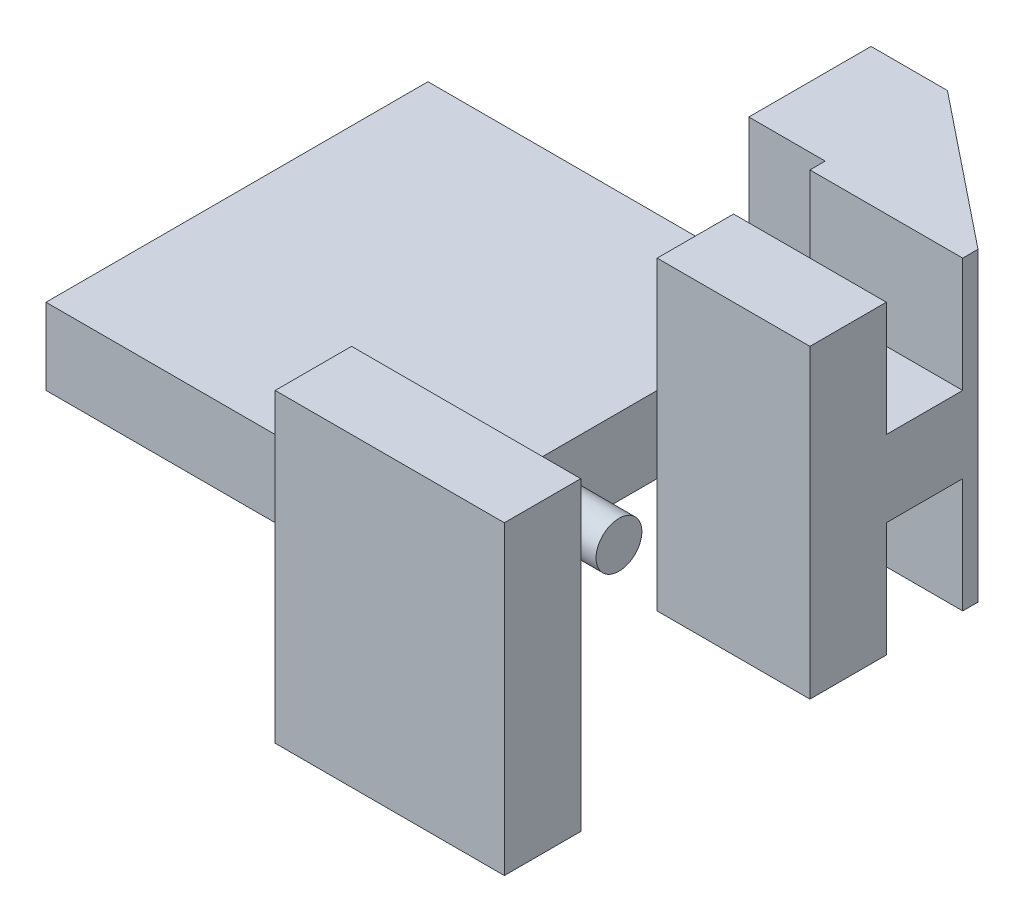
ISO-10303-21;
HEADER;
FILE_DESCRIPTION(('STEP AP214'),'2;1');
FILE_NAME('part.step','',(''),(''),'','','');
FILE_SCHEMA(('AUTOMOTIVE_DESIGN { 1 0 10303 214 1 1 1 1 }'));
ENDSEC;
DATA;
#1=APPLICATION_CONTEXT('core data for automotive mechanical design processes');
#2=APPLICATION_PROTOCOL_DEFINITION('international standard','automotive_design',2000,#1);
#3=PRODUCT_CONTEXT('',#1,'mechanical');
#4=PRODUCT('Part','Part','',(#3));
#5=PRODUCT_RELATED_PRODUCT_CATEGORY('part','',(#4));
#6=PRODUCT_DEFINITION_FORMATION('','',#4);
#7=PRODUCT_DEFINITION_CONTEXT('part definition',#1,'design');
#8=PRODUCT_DEFINITION('design','',#6,#7);
#9=PRODUCT_DEFINITION_SHAPE('','',#8);
#10=(LENGTH_UNIT() NAMED_UNIT(*) SI_UNIT(.MILLI.,.METRE.));
#11=(NAMED_UNIT(*) PLANE_ANGLE_UNIT() SI_UNIT($,.RADIAN.));
#12=(NAMED_UNIT(*) SI_UNIT($,.STERADIAN.) SOLID_ANGLE_UNIT());
#13=UNCERTAINTY_MEASURE_WITH_UNIT(LENGTH_MEASURE(1.E-05),#10,'distance_accuracy_value','');
#14=(GEOMETRIC_REPRESENTATION_CONTEXT(3) GLOBAL_UNCERTAINTY_ASSIGNED_CONTEXT((#13)) GLOBAL_UNIT_ASSIGNED_CONTEXT((#10,
#11,#12)) REPRESENTATION_CONTEXT('',''));
#15=CARTESIAN_POINT('',(0.,0.,0.));
#16=DIRECTION('',(0.,0.,1.));
#17=DIRECTION('',(1.,0.,0.));
#18=AXIS2_PLACEMENT_3D('',#15,#16,#17);
#19=CARTESIAN_POINT('',(0.,-10.,0.));
#20=DIRECTION('',(0.,1.,0.));
#21=DIRECTION('',(0.,0.,1.));
#22=AXIS2_PLACEMENT_3D('',#19,#20,#21);
#23=PLANE('',#22);
#24=DIRECTION('',(0.,0.,-1.));
#25=VECTOR('',#24,1.);
#26=CARTESIAN_POINT('',(10.,-10.,-18.5));
#27=LINE('',#26,#25);
#28=CARTESIAN_POINT('',(10.,-10.,-17.5));
#29=VERTEX_POINT('',#28);
#30=CARTESIAN_POINT('',(10.,-10.,-18.5));
#31=VERTEX_POINT('',#30);
#32=EDGE_CURVE('E283',#29,#31,#27,.T.);
#33=ORIENTED_EDGE('',*,*,#32,.F.);
#34=DIRECTION('',(-1.,0.,0.));
#35=VECTOR('',#34,1.);
#36=CARTESIAN_POINT('',(10.,-10.,-17.5));
#37=LINE('',#36,#35);
#38=CARTESIAN_POINT('',(0.,-10.,-17.5));
#39=VERTEX_POINT('',#38);
#40=EDGE_CURVE('E528',#29,#39,#37,.T.);
#41=ORIENTED_EDGE('',*,*,#40,.T.);
#42=DIRECTION('',(0.,0.,-1.));
#43=VECTOR('',#42,1.);
#44=CARTESIAN_POINT('',(0.,-10.,0.));
#45=LINE('',#44,#43);
#46=CARTESIAN_POINT('',(0.,-10.,-18.5));
#47=VERTEX_POINT('',#46);
#48=EDGE_CURVE('E363',#39,#47,#45,.T.);
#49=ORIENTED_EDGE('',*,*,#48,.T.);
#50=DIRECTION('',(1.,0.,0.));
#51=VECTOR('',#50,1.);
#52=CARTESIAN_POINT('',(0.,-10.,-18.5));
#53=LINE('',#52,#51);
#54=CARTESIAN_POINT('',(-5.,-10.,-18.5));
#55=VERTEX_POINT('',#54);
#56=EDGE_CURVE('E368',#55,#47,#53,.T.);
#57=ORIENTED_EDGE('',*,*,#56,.F.);
#58=DIRECTION('',(0.,0.,1.));
#59=VECTOR('',#58,1.);
#60=CARTESIAN_POINT('',(-5.,-10.,-26.5));
#61=LINE('',#60,#59);
#62=CARTESIAN_POINT('',(-5.,-10.,-26.5));
#63=VERTEX_POINT('',#62);
#64=EDGE_CURVE('E295',#63,#55,#61,.T.);
#65=ORIENTED_EDGE('',*,*,#64,.F.);
#66=DIRECTION('',(-1.,0.,0.));
#67=VECTOR('',#66,1.);
#68=CARTESIAN_POINT('',(-5.,-10.,-26.5));
#69=LINE('',#68,#67);
#70=CARTESIAN_POINT('',(0.,-10.,-26.5));
#71=VERTEX_POINT('',#70);
#72=EDGE_CURVE('E292',#71,#63,#69,.T.);
#73=ORIENTED_EDGE('',*,*,#72,.F.);
#74=DIRECTION('',(-0.78086880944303,0.,-0.624695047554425));
#75=VECTOR('',#74,1.);
#76=CARTESIAN_POINT('',(0.,-10.,-26.5));
#77=LINE('',#76,#75);
#78=EDGE_CURVE('E289',#31,#71,#77,.T.);
#79=ORIENTED_EDGE('',*,*,#78,.F.);
#80=EDGE_LOOP('',(#33,#41,#49,#57,#65,#73,#79));
#81=FACE_BOUND('',#80,.T.);
#82=ADVANCED_FACE('F39',(#81),#23,.F.);
#83=CARTESIAN_POINT('',(0.,10.,0.));
#84=DIRECTION('',(0.,1.,0.));
#85=DIRECTION('',(0.,0.,1.));
#86=AXIS2_PLACEMENT_3D('',#83,#84,#85);
#87=PLANE('',#86);
#88=DIRECTION('',(-1.,0.,0.));
#89=VECTOR('',#88,1.);
#90=CARTESIAN_POINT('',(10.,10.,-12.5));
#91=LINE('',#90,#89);
#92=CARTESIAN_POINT('',(10.,10.,-12.5));
#93=VERTEX_POINT('',#92);
#94=CARTESIAN_POINT('',(0.,10.,-12.5));
#95=VERTEX_POINT('',#94);
#96=EDGE_CURVE('E221',#93,#95,#91,.T.);
#97=ORIENTED_EDGE('',*,*,#96,.T.);
#98=DIRECTION('',(0.,0.,-1.));
#99=VECTOR('',#98,1.);
#100=CARTESIAN_POINT('',(0.,10.,0.));
#101=LINE('',#100,#99);
#102=CARTESIAN_POINT('',(0.,10.,-7.5));
#103=VERTEX_POINT('',#102);
#104=EDGE_CURVE('E48',#103,#95,#101,.T.);
#105=ORIENTED_EDGE('',*,*,#104,.F.);
#106=DIRECTION('',(1.,0.,0.));
#107=VECTOR('',#106,1.);
#108=CARTESIAN_POINT('',(10.,10.,-7.5));
#109=LINE('',#108,#107);
#110=CARTESIAN_POINT('',(10.,10.,-7.5));
#111=VERTEX_POINT('',#110);
#112=EDGE_CURVE('E248',#103,#111,#109,.T.);
#113=ORIENTED_EDGE('',*,*,#112,.T.);
#114=DIRECTION('',(0.,0.,-1.));
#115=VECTOR('',#114,1.);
#116=CARTESIAN_POINT('',(10.,10.,-18.5));
#117=LINE('',#116,#115);
#118=EDGE_CURVE('E239',#111,#93,#117,.T.);
#119=ORIENTED_EDGE('',*,*,#118,.T.);
#120=EDGE_LOOP('',(#97,#105,#113,#119));
#121=FACE_BOUND('',#120,.T.);
#122=ADVANCED_FACE('F246',(#121),#87,.T.);
#123=CARTESIAN_POINT('',(0.,0.,0.));
#124=DIRECTION('',(1.,0.,0.));
#125=DIRECTION('',(0.,0.,-1.));
#126=AXIS2_PLACEMENT_3D('',#123,#124,#125);
#127=PLANE('',#126);
#128=ORIENTED_EDGE('',*,*,#48,.F.);
#129=DIRECTION('',(0.,-1.,0.));
#130=VECTOR('',#129,1.);
#131=CARTESIAN_POINT('',(0.,-10.,-17.5));
#132=LINE('',#131,#130);
#133=CARTESIAN_POINT('',(0.,-2.5,-17.5));
#134=VERTEX_POINT('',#133);
#135=EDGE_CURVE('E606',#134,#39,#132,.T.);
#136=ORIENTED_EDGE('',*,*,#135,.F.);
#137=DIRECTION('',(0.,0.,1.));
#138=VECTOR('',#137,1.);
#139=CARTESIAN_POINT('',(0.,-2.5,0.));
#140=LINE('',#139,#138);
#141=CARTESIAN_POINT('',(0.,-2.5,-18.5));
#142=VERTEX_POINT('',#141);
#143=EDGE_CURVE('E535',#142,#134,#140,.T.);
#144=ORIENTED_EDGE('',*,*,#143,.F.);
#145=DIRECTION('',(0.,-1.,0.));
#146=VECTOR('',#145,1.);
#147=CARTESIAN_POINT('',(0.,0.,-18.5));
#148=LINE('',#147,#146);
#149=EDGE_CURVE('E533',#142,#47,#148,.T.);
#150=ORIENTED_EDGE('',*,*,#149,.T.);
#151=EDGE_LOOP('',(#128,#136,#144,#150));
#152=FACE_BOUND('',#151,.T.);
#153=ADVANCED_FACE('F466',(#152),#127,.F.);
#154=CARTESIAN_POINT('',(0.,0.,0.));
#155=DIRECTION('',(1.,0.,0.));
#156=DIRECTION('',(0.,0.,-1.));
#157=AXIS2_PLACEMENT_3D('',#154,#155,#156);
#158=PLANE('',#157);
#159=ORIENTED_EDGE('',*,*,#104,.T.);
#160=DIRECTION('',(0.,1.,0.));
#161=VECTOR('',#160,1.);
#162=CARTESIAN_POINT('',(0.,2.5,-12.5));
#163=LINE('',#162,#161);
#164=CARTESIAN_POINT('',(0.,2.5,-12.5));
#165=VERTEX_POINT('',#164);
#166=EDGE_CURVE('E227',#165,#95,#163,.T.);
#167=ORIENTED_EDGE('',*,*,#166,.F.);
#168=DIRECTION('',(0.,0.,-1.));
#169=VECTOR('',#168,1.);
#170=CARTESIAN_POINT('',(0.,2.5,0.));
#171=LINE('',#170,#169);
#172=CARTESIAN_POINT('',(0.,2.5,-7.5));
#173=VERTEX_POINT('',#172);
#174=EDGE_CURVE('E559',#173,#165,#171,.T.);
#175=ORIENTED_EDGE('',*,*,#174,.F.);
#176=DIRECTION('',(0.,-1.,0.));
#177=VECTOR('',#176,1.);
#178=CARTESIAN_POINT('',(0.,10.,-7.5));
#179=LINE('',#178,#177);
#180=EDGE_CURVE('E359',#103,#173,#179,.T.);
#181=ORIENTED_EDGE('',*,*,#180,.F.);
#182=EDGE_LOOP('',(#159,#167,#175,#181));
#183=FACE_BOUND('',#182,.T.);
#184=ADVANCED_FACE('F577',(#183),#158,.F.);
#185=CARTESIAN_POINT('',(-5.,10.,-26.5));
#186=DIRECTION('',(1.,0.,0.));
#187=DIRECTION('',(0.,0.,-1.));
#188=AXIS2_PLACEMENT_3D('',#185,#186,#187);
#189=PLANE('',#188);
#190=DIRECTION('',(0.,-1.,0.));
#191=VECTOR('',#190,1.);
#192=CARTESIAN_POINT('',(-5.,10.,-17.5));
#193=LINE('',#192,#191);
#194=CARTESIAN_POINT('',(-5.,2.5,-17.5));
#195=VERTEX_POINT('',#194);
#196=CARTESIAN_POINT('',(-5.,-2.5,-17.5));
#197=VERTEX_POINT('',#196);
#198=EDGE_CURVE('E339',#195,#197,#193,.T.);
#199=ORIENTED_EDGE('',*,*,#198,.F.);
#200=DIRECTION('',(0.,0.,-1.));
#201=VECTOR('',#200,1.);
#202=CARTESIAN_POINT('',(-5.,2.5,-26.5));
#203=LINE('',#202,#201);
#204=CARTESIAN_POINT('',(-5.,2.5,-18.5));
#205=VERTEX_POINT('',#204);
#206=EDGE_CURVE('E284',#195,#205,#203,.T.);
#207=ORIENTED_EDGE('',*,*,#206,.T.);
#208=DIRECTION('',(0.,1.,0.));
#209=VECTOR('',#208,1.);
#210=CARTESIAN_POINT('',(-5.,10.,-18.5));
#211=LINE('',#210,#209);
#212=CARTESIAN_POINT('',(-5.,10.,-18.5));
#213=VERTEX_POINT('',#212);
#214=EDGE_CURVE('E406',#205,#213,#211,.T.);
#215=ORIENTED_EDGE('',*,*,#214,.T.);
#216=DIRECTION('',(0.,0.,1.));
#217=VECTOR('',#216,1.);
#218=CARTESIAN_POINT('',(-5.,10.,-26.5));
#219=LINE('',#218,#217);
#220=CARTESIAN_POINT('',(-5.,10.,-26.5));
#221=VERTEX_POINT('',#220);
#222=EDGE_CURVE('E263',#221,#213,#219,.T.);
#223=ORIENTED_EDGE('',*,*,#222,.F.);
#224=DIRECTION('',(0.,-1.,0.));
#225=VECTOR('',#224,1.);
#226=CARTESIAN_POINT('',(-5.,10.,-26.5));
#227=LINE('',#226,#225);
#228=EDGE_CURVE('E343',#221,#63,#227,.T.);
#229=ORIENTED_EDGE('',*,*,#228,.T.);
#230=ORIENTED_EDGE('',*,*,#64,.T.);
#231=DIRECTION('',(0.,-1.,0.));
#232=VECTOR('',#231,1.);
#233=CARTESIAN_POINT('',(-5.,10.,-18.5));
#234=LINE('',#233,#232);
#235=CARTESIAN_POINT('',(-5.,-2.5,-18.5));
#236=VERTEX_POINT('',#235);
#237=EDGE_CURVE('E409',#236,#55,#234,.T.);
#238=ORIENTED_EDGE('',*,*,#237,.F.);
#239=DIRECTION('',(0.,0.,1.));
#240=VECTOR('',#239,1.);
#241=CARTESIAN_POINT('',(-5.,-2.5,-26.5));
#242=LINE('',#241,#240);
#243=EDGE_CURVE('E414',#236,#197,#242,.T.);
#244=ORIENTED_EDGE('',*,*,#243,.T.);
#245=EDGE_LOOP('',(#199,#207,#215,#223,#229,#230,#238,#244));
#246=FACE_BOUND('',#245,.T.);
#247=ADVANCED_FACE('F403',(#246),#189,.F.);
#248=DIRECTION('',(-1.,0.,0.));
#249=VECTOR('',#248,1.);
#250=CARTESIAN_POINT('',(10.,10.,7.5));
#251=LINE('',#250,#249);
#252=CARTESIAN_POINT('',(10.,10.,7.5));
#253=VERTEX_POINT('',#252);
#254=CARTESIAN_POINT('',(-5.,10.,7.5));
#255=VERTEX_POINT('',#254);
#256=EDGE_CURVE('E276',#253,#255,#251,.T.);
#257=ORIENTED_EDGE('',*,*,#256,.T.);
#258=DIRECTION('',(0.,0.,1.));
#259=VECTOR('',#258,1.);
#260=CARTESIAN_POINT('',(-5.,10.,7.5));
#261=LINE('',#260,#259);
#262=CARTESIAN_POINT('',(-5.,10.,12.5));
#263=VERTEX_POINT('',#262);
#264=EDGE_CURVE('E267',#255,#263,#261,.T.);
#265=ORIENTED_EDGE('',*,*,#264,.T.);
#266=DIRECTION('',(1.,0.,0.));
#267=VECTOR('',#266,1.);
#268=CARTESIAN_POINT('',(-5.,10.,12.5));
#269=LINE('',#268,#267);
#270=CARTESIAN_POINT('',(10.,10.,12.5));
#271=VERTEX_POINT('',#270);
#272=EDGE_CURVE('E270',#263,#271,#269,.T.);
#273=ORIENTED_EDGE('',*,*,#272,.T.);
#274=DIRECTION('',(0.,0.,-1.));
#275=VECTOR('',#274,1.);
#276=CARTESIAN_POINT('',(10.,10.,12.5));
#277=LINE('',#276,#275);
#278=EDGE_CURVE('E273',#271,#253,#277,.T.);
#279=ORIENTED_EDGE('',*,*,#278,.T.);
#280=EDGE_LOOP('',(#257,#265,#273,#279));
#281=FACE_BOUND('',#280,.T.);
#282=ADVANCED_FACE('F468',(#281),#87,.T.);
#283=CARTESIAN_POINT('',(0.,-10.,-7.5));
#284=VERTEX_POINT('',#283);
#285=CARTESIAN_POINT('',(0.,-10.,-12.5));
#286=VERTEX_POINT('',#285);
#287=EDGE_CURVE('E364',#284,#286,#45,.T.);
#288=ORIENTED_EDGE('',*,*,#287,.T.);
#289=DIRECTION('',(-1.,0.,0.));
#290=VECTOR('',#289,1.);
#291=CARTESIAN_POINT('',(10.,-10.,-12.5));
#292=LINE('',#291,#290);
#293=CARTESIAN_POINT('',(10.,-10.,-12.5));
#294=VERTEX_POINT('',#293);
#295=EDGE_CURVE('E55',#294,#286,#292,.T.);
#296=ORIENTED_EDGE('',*,*,#295,.F.);
#297=CARTESIAN_POINT('',(10.,-10.,-7.5));
#298=VERTEX_POINT('',#297);
#299=EDGE_CURVE('E285',#298,#294,#27,.T.);
#300=ORIENTED_EDGE('',*,*,#299,.F.);
#301=DIRECTION('',(1.,0.,0.));
#302=VECTOR('',#301,1.);
#303=CARTESIAN_POINT('',(10.,-10.,-7.5));
#304=LINE('',#303,#302);
#305=EDGE_CURVE('E280',#284,#298,#304,.T.);
#306=ORIENTED_EDGE('',*,*,#305,.F.);
#307=EDGE_LOOP('',(#288,#296,#300,#306));
#308=FACE_BOUND('',#307,.T.);
#309=ADVANCED_FACE('F461',(#308),#23,.F.);
#310=CARTESIAN_POINT('',(0.,10.,-7.5));
#311=DIRECTION('',(-1.,0.,0.));
#312=DIRECTION('',(0.,0.,1.));
#313=AXIS2_PLACEMENT_3D('',#310,#311,#312);
#314=PLANE('',#313);
#315=CARTESIAN_POINT('',(0.,0.,0.));
#316=DIRECTION('',(-1.,0.,0.));
#317=DIRECTION('',(0.,0.,1.));
#318=AXIS2_PLACEMENT_3D('',#315,#316,#317);
#319=CIRCLE('',#318,1.5);
#320=CARTESIAN_POINT('',(0.,0.,1.5));
#321=VERTEX_POINT('',#320);
#322=EDGE_CURVE('E11',#321,#321,#319,.F.);
#323=ORIENTED_EDGE('',*,*,#322,.F.);
#324=EDGE_LOOP('',(#323));
#325=FACE_BOUND('',#324,.T.);
#326=CARTESIAN_POINT('',(0.,-2.5,-7.5));
#327=VERTEX_POINT('',#326);
#328=EDGE_CURVE('E358',#173,#327,#179,.T.);
#329=ORIENTED_EDGE('',*,*,#328,.F.);
#330=CARTESIAN_POINT('',(0.,2.5,7.5));
#331=VERTEX_POINT('',#330);
#332=EDGE_CURVE('E395',#331,#173,#171,.T.);
#333=ORIENTED_EDGE('',*,*,#332,.F.);
#334=DIRECTION('',(0.,-1.,0.));
#335=VECTOR('',#334,1.);
#336=CARTESIAN_POINT('',(0.,10.,7.5));
#337=LINE('',#336,#335);
#338=CARTESIAN_POINT('',(0.,-2.5,7.5));
#339=VERTEX_POINT('',#338);
#340=EDGE_CURVE('E279',#331,#339,#337,.T.);
#341=ORIENTED_EDGE('',*,*,#340,.T.);
#342=EDGE_CURVE('E539',#327,#339,#140,.T.);
#343=ORIENTED_EDGE('',*,*,#342,.F.);
#344=EDGE_LOOP('',(#329,#333,#341,#343));
#345=FACE_BOUND('',#344,.T.);
#346=ADVANCED_FACE('F41',(#325,#345),#314,.F.);
#347=CARTESIAN_POINT('',(10.,10.,-7.5));
#348=DIRECTION('',(0.,0.,-1.));
#349=DIRECTION('',(-1.,0.,0.));
#350=AXIS2_PLACEMENT_3D('',#347,#348,#349);
#351=PLANE('',#350);
#352=ORIENTED_EDGE('',*,*,#305,.T.);
#353=DIRECTION('',(0.,-1.,0.));
#354=VECTOR('',#353,1.);
#355=CARTESIAN_POINT('',(10.,10.,-7.5));
#356=LINE('',#355,#354);
#357=EDGE_CURVE('E355',#111,#298,#356,.T.);
#358=ORIENTED_EDGE('',*,*,#357,.F.);
#359=ORIENTED_EDGE('',*,*,#112,.F.);
#360=ORIENTED_EDGE('',*,*,#180,.T.);
#361=ORIENTED_EDGE('',*,*,#328,.T.);
#362=DIRECTION('',(0.,-1.,0.));
#363=VECTOR('',#362,1.);
#364=CARTESIAN_POINT('',(0.,10.,-7.5));
#365=LINE('',#364,#363);
#366=EDGE_CURVE('E548',#327,#284,#365,.T.);
#367=ORIENTED_EDGE('',*,*,#366,.T.);
#368=EDGE_LOOP('',(#352,#358,#359,#360,#361,#367));
#369=FACE_BOUND('',#368,.T.);
#370=ADVANCED_FACE('F632',(#369),#351,.F.);
#371=CARTESIAN_POINT('',(10.,10.,-18.5));
#372=DIRECTION('',(-1.,0.,0.));
#373=DIRECTION('',(0.,0.,1.));
#374=AXIS2_PLACEMENT_3D('',#371,#372,#373);
#375=PLANE('',#374);
#376=DIRECTION('',(0.,0.,1.));
#377=VECTOR('',#376,1.);
#378=CARTESIAN_POINT('',(10.,2.5,-17.5));
#379=LINE('',#378,#377);
#380=CARTESIAN_POINT('',(10.,2.5,-17.5));
#381=VERTEX_POINT('',#380);
#382=CARTESIAN_POINT('',(10.,2.5,-12.5));
#383=VERTEX_POINT('',#382);
#384=EDGE_CURVE('E233',#381,#383,#379,.T.);
#385=ORIENTED_EDGE('',*,*,#384,.T.);
#386=DIRECTION('',(0.,1.,0.));
#387=VECTOR('',#386,1.);
#388=CARTESIAN_POINT('',(10.,2.5,-12.5));
#389=LINE('',#388,#387);
#390=EDGE_CURVE('E224',#383,#93,#389,.T.);
#391=ORIENTED_EDGE('',*,*,#390,.T.);
#392=ORIENTED_EDGE('',*,*,#118,.F.);
#393=ORIENTED_EDGE('',*,*,#357,.T.);
#394=ORIENTED_EDGE('',*,*,#299,.T.);
#395=DIRECTION('',(0.,1.,0.));
#396=VECTOR('',#395,1.);
#397=CARTESIAN_POINT('',(10.,-2.5,-12.5));
#398=LINE('',#397,#396);
#399=CARTESIAN_POINT('',(10.,-2.5,-12.5));
#400=VERTEX_POINT('',#399);
#401=EDGE_CURVE('E598',#294,#400,#398,.T.);
#402=ORIENTED_EDGE('',*,*,#401,.T.);
#403=DIRECTION('',(0.,0.,-1.));
#404=VECTOR('',#403,1.);
#405=CARTESIAN_POINT('',(10.,-2.5,-17.5));
#406=LINE('',#405,#404);
#407=CARTESIAN_POINT('',(10.,-2.5,-17.5));
#408=VERTEX_POINT('',#407);
#409=EDGE_CURVE('E603',#400,#408,#406,.T.);
#410=ORIENTED_EDGE('',*,*,#409,.T.);
#411=DIRECTION('',(0.,-1.,0.));
#412=VECTOR('',#411,1.);
#413=CARTESIAN_POINT('',(10.,-10.,-17.5));
#414=LINE('',#413,#412);
#415=EDGE_CURVE('E436',#408,#29,#414,.T.);
#416=ORIENTED_EDGE('',*,*,#415,.T.);
#417=ORIENTED_EDGE('',*,*,#32,.T.);
#418=DIRECTION('',(0.,-1.,0.));
#419=VECTOR('',#418,1.);
#420=CARTESIAN_POINT('',(10.,10.,-18.5));
#421=LINE('',#420,#419);
#422=CARTESIAN_POINT('',(10.,10.,-18.5));
#423=VERTEX_POINT('',#422);
#424=EDGE_CURVE('E351',#423,#31,#421,.T.);
#425=ORIENTED_EDGE('',*,*,#424,.F.);
#426=CARTESIAN_POINT('',(10.,10.,-17.5));
#427=VERTEX_POINT('',#426);
#428=EDGE_CURVE('E252',#427,#423,#117,.T.);
#429=ORIENTED_EDGE('',*,*,#428,.F.);
#430=DIRECTION('',(0.,-1.,0.));
#431=VECTOR('',#430,1.);
#432=CARTESIAN_POINT('',(10.,10.,-17.5));
#433=LINE('',#432,#431);
#434=EDGE_CURVE('E243',#427,#381,#433,.T.);
#435=ORIENTED_EDGE('',*,*,#434,.T.);
#436=EDGE_LOOP('',(#385,#391,#392,#393,#394,#402,#410,#416,#417,#425,#429,#435));
#437=FACE_BOUND('',#436,.T.);
#438=ADVANCED_FACE('F237',(#437),#375,.F.);
#439=CARTESIAN_POINT('',(0.,10.,-26.5));
#440=DIRECTION('',(-0.624695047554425,0.,0.78086880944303));
#441=DIRECTION('',(0.78086880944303,0.,0.624695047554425));
#442=AXIS2_PLACEMENT_3D('',#439,#440,#441);
#443=PLANE('',#442);
#444=ORIENTED_EDGE('',*,*,#78,.T.);
#445=DIRECTION('',(0.,-1.,0.));
#446=VECTOR('',#445,1.);
#447=CARTESIAN_POINT('',(0.,10.,-26.5));
#448=LINE('',#447,#446);
#449=CARTESIAN_POINT('',(0.,10.,-26.5));
#450=VERTEX_POINT('',#449);
#451=EDGE_CURVE('E347',#450,#71,#448,.T.);
#452=ORIENTED_EDGE('',*,*,#451,.F.);
#453=DIRECTION('',(-0.78086880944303,0.,-0.624695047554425));
#454=VECTOR('',#453,1.);
#455=CARTESIAN_POINT('',(0.,10.,-26.5));
#456=LINE('',#455,#454);
#457=EDGE_CURVE('E251',#423,#450,#456,.T.);
#458=ORIENTED_EDGE('',*,*,#457,.F.);
#459=ORIENTED_EDGE('',*,*,#424,.T.);
#460=EDGE_LOOP('',(#444,#452,#458,#459));
#461=FACE_BOUND('',#460,.T.);
#462=ADVANCED_FACE('F441',(#461),#443,.F.);
#463=CARTESIAN_POINT('',(-5.,10.,-26.5));
#464=DIRECTION('',(0.,0.,1.));
#465=DIRECTION('',(1.,0.,0.));
#466=AXIS2_PLACEMENT_3D('',#463,#464,#465);
#467=PLANE('',#466);
#468=ORIENTED_EDGE('',*,*,#72,.T.);
#469=ORIENTED_EDGE('',*,*,#228,.F.);
#470=DIRECTION('',(-1.,0.,0.));
#471=VECTOR('',#470,1.);
#472=CARTESIAN_POINT('',(-5.,10.,-26.5));
#473=LINE('',#472,#471);
#474=EDGE_CURVE('E256',#450,#221,#473,.T.);
#475=ORIENTED_EDGE('',*,*,#474,.F.);
#476=ORIENTED_EDGE('',*,*,#451,.T.);
#477=EDGE_LOOP('',(#468,#469,#475,#476));
#478=FACE_BOUND('',#477,.T.);
#479=ADVANCED_FACE('F446',(#478),#467,.F.);
#480=CARTESIAN_POINT('',(-25.,10.,-17.5));
#481=DIRECTION('',(0.,0.,1.));
#482=DIRECTION('',(1.,0.,0.));
#483=AXIS2_PLACEMENT_3D('',#480,#481,#482);
#484=PLANE('',#483);
#485=DIRECTION('',(0.,-1.,0.));
#486=VECTOR('',#485,1.);
#487=CARTESIAN_POINT('',(-25.,10.,-17.5));
#488=LINE('',#487,#486);
#489=CARTESIAN_POINT('',(-25.,2.5,-17.5));
#490=VERTEX_POINT('',#489);
#491=CARTESIAN_POINT('',(-25.,-2.5,-17.5));
#492=VERTEX_POINT('',#491);
#493=EDGE_CURVE('E335',#490,#492,#488,.T.);
#494=ORIENTED_EDGE('',*,*,#493,.F.);
#495=DIRECTION('',(1.,0.,0.));
#496=VECTOR('',#495,1.);
#497=CARTESIAN_POINT('',(-25.,2.5,-17.5));
#498=LINE('',#497,#496);
#499=EDGE_CURVE('E423',#490,#195,#498,.T.);
#500=ORIENTED_EDGE('',*,*,#499,.T.);
#501=ORIENTED_EDGE('',*,*,#198,.T.);
#502=DIRECTION('',(-1.,0.,0.));
#503=VECTOR('',#502,1.);
#504=CARTESIAN_POINT('',(-25.,-2.5,-17.5));
#505=LINE('',#504,#503);
#506=EDGE_CURVE('E408',#197,#492,#505,.T.);
#507=ORIENTED_EDGE('',*,*,#506,.T.);
#508=EDGE_LOOP('',(#494,#500,#501,#507));
#509=FACE_BOUND('',#508,.T.);
#510=ADVANCED_FACE('F448',(#509),#484,.F.);
#511=CARTESIAN_POINT('',(-25.,10.,-17.5));
#512=DIRECTION('',(1.,0.,0.));
#513=DIRECTION('',(0.,0.,-1.));
#514=AXIS2_PLACEMENT_3D('',#511,#512,#513);
#515=PLANE('',#514);
#516=DIRECTION('',(0.,-1.,0.));
#517=VECTOR('',#516,1.);
#518=CARTESIAN_POINT('',(-25.,10.,7.5));
#519=LINE('',#518,#517);
#520=CARTESIAN_POINT('',(-25.,2.5,7.5));
#521=VERTEX_POINT('',#520);
#522=CARTESIAN_POINT('',(-25.,-2.5,7.5));
#523=VERTEX_POINT('',#522);
#524=EDGE_CURVE('E331',#521,#523,#519,.T.);
#525=ORIENTED_EDGE('',*,*,#524,.F.);
#526=DIRECTION('',(0.,0.,1.));
#527=VECTOR('',#526,1.);
#528=CARTESIAN_POINT('',(-25.,2.5,0.));
#529=LINE('',#528,#527);
#530=EDGE_CURVE('E515',#490,#521,#529,.T.);
#531=ORIENTED_EDGE('',*,*,#530,.F.);
#532=ORIENTED_EDGE('',*,*,#493,.T.);
#533=DIRECTION('',(0.,0.,-1.));
#534=VECTOR('',#533,1.);
#535=CARTESIAN_POINT('',(-25.,-2.5,0.));
#536=LINE('',#535,#534);
#537=EDGE_CURVE('E567',#523,#492,#536,.T.);
#538=ORIENTED_EDGE('',*,*,#537,.F.);
#539=EDGE_LOOP('',(#525,#531,#532,#538));
#540=FACE_BOUND('',#539,.T.);
#541=ADVANCED_FACE('F454',(#540),#515,.F.);
#542=CARTESIAN_POINT('',(-25.,10.,7.5));
#543=DIRECTION('',(0.,0.,-1.));
#544=DIRECTION('',(-1.,0.,0.));
#545=AXIS2_PLACEMENT_3D('',#542,#543,#544);
#546=PLANE('',#545);
#547=DIRECTION('',(0.,-1.,0.));
#548=VECTOR('',#547,1.);
#549=CARTESIAN_POINT('',(-5.,10.,7.5));
#550=LINE('',#549,#548);
#551=CARTESIAN_POINT('',(-5.,2.5,7.5));
#552=VERTEX_POINT('',#551);
#553=CARTESIAN_POINT('',(-5.,-2.5,7.5));
#554=VERTEX_POINT('',#553);
#555=EDGE_CURVE('E326',#552,#554,#550,.T.);
#556=ORIENTED_EDGE('',*,*,#555,.F.);
#557=DIRECTION('',(1.,0.,0.));
#558=VECTOR('',#557,1.);
#559=CARTESIAN_POINT('',(-52.0601182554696,2.5,7.5));
#560=LINE('',#559,#558);
#561=EDGE_CURVE('E510',#521,#552,#560,.T.);
#562=ORIENTED_EDGE('',*,*,#561,.F.);
#563=ORIENTED_EDGE('',*,*,#524,.T.);
#564=DIRECTION('',(1.,0.,0.));
#565=VECTOR('',#564,1.);
#566=CARTESIAN_POINT('',(-52.0601182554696,-2.5,7.5));
#567=LINE('',#566,#565);
#568=EDGE_CURVE('E521',#523,#554,#567,.T.);
#569=ORIENTED_EDGE('',*,*,#568,.T.);
#570=EDGE_LOOP('',(#556,#562,#563,#569));
#571=FACE_BOUND('',#570,.T.);
#572=ADVANCED_FACE('F520',(#571),#546,.F.);
#573=CARTESIAN_POINT('',(-5.,10.,7.5));
#574=DIRECTION('',(1.,0.,0.));
#575=DIRECTION('',(0.,0.,-1.));
#576=AXIS2_PLACEMENT_3D('',#573,#574,#575);
#577=PLANE('',#576);
#578=DIRECTION('',(0.,0.,1.));
#579=VECTOR('',#578,1.);
#580=CARTESIAN_POINT('',(-5.,-10.,7.5));
#581=LINE('',#580,#579);
#582=CARTESIAN_POINT('',(-5.,-10.,7.5));
#583=VERTEX_POINT('',#582);
#584=CARTESIAN_POINT('',(-5.,-10.,12.5));
#585=VERTEX_POINT('',#584);
#586=EDGE_CURVE('E299',#583,#585,#581,.T.);
#587=ORIENTED_EDGE('',*,*,#586,.T.);
#588=DIRECTION('',(0.,-1.,0.));
#589=VECTOR('',#588,1.);
#590=CARTESIAN_POINT('',(-5.,10.,12.5));
#591=LINE('',#590,#589);
#592=EDGE_CURVE('E322',#263,#585,#591,.T.);
#593=ORIENTED_EDGE('',*,*,#592,.F.);
#594=ORIENTED_EDGE('',*,*,#264,.F.);
#595=EDGE_CURVE('E327',#255,#552,#550,.T.);
#596=ORIENTED_EDGE('',*,*,#595,.T.);
#597=ORIENTED_EDGE('',*,*,#555,.T.);
#598=DIRECTION('',(0.,-1.,0.));
#599=VECTOR('',#598,1.);
#600=CARTESIAN_POINT('',(-5.,10.,7.5));
#601=LINE('',#600,#599);
#602=EDGE_CURVE('E416',#554,#583,#601,.T.);
#603=ORIENTED_EDGE('',*,*,#602,.T.);
#604=EDGE_LOOP('',(#587,#593,#594,#596,#597,#603));
#605=FACE_BOUND('',#604,.T.);
#606=ADVANCED_FACE('F490',(#605),#577,.F.);
#607=CARTESIAN_POINT('',(-5.,10.,12.5));
#608=DIRECTION('',(0.,0.,-1.));
#609=DIRECTION('',(-1.,0.,0.));
#610=AXIS2_PLACEMENT_3D('',#607,#608,#609);
#611=PLANE('',#610);
#612=DIRECTION('',(1.,0.,0.));
#613=VECTOR('',#612,1.);
#614=CARTESIAN_POINT('',(-5.,-10.,12.5));
#615=LINE('',#614,#613);
#616=CARTESIAN_POINT('',(10.,-10.,12.5));
#617=VERTEX_POINT('',#616);
#618=EDGE_CURVE('E302',#585,#617,#615,.T.);
#619=ORIENTED_EDGE('',*,*,#618,.T.);
#620=DIRECTION('',(0.,-1.,0.));
#621=VECTOR('',#620,1.);
#622=CARTESIAN_POINT('',(10.,10.,12.5));
#623=LINE('',#622,#621);
#624=EDGE_CURVE('E318',#271,#617,#623,.T.);
#625=ORIENTED_EDGE('',*,*,#624,.F.);
#626=ORIENTED_EDGE('',*,*,#272,.F.);
#627=ORIENTED_EDGE('',*,*,#592,.T.);
#628=EDGE_LOOP('',(#619,#625,#626,#627));
#629=FACE_BOUND('',#628,.T.);
#630=ADVANCED_FACE('F495',(#629),#611,.F.);
#631=CARTESIAN_POINT('',(10.,10.,12.5));
#632=DIRECTION('',(-1.,0.,0.));
#633=DIRECTION('',(0.,0.,1.));
#634=AXIS2_PLACEMENT_3D('',#631,#632,#633);
#635=PLANE('',#634);
#636=DIRECTION('',(0.,0.,-1.));
#637=VECTOR('',#636,1.);
#638=CARTESIAN_POINT('',(10.,-10.,12.5));
#639=LINE('',#638,#637);
#640=CARTESIAN_POINT('',(10.,-10.,7.5));
#641=VERTEX_POINT('',#640);
#642=EDGE_CURVE('E305',#617,#641,#639,.T.);
#643=ORIENTED_EDGE('',*,*,#642,.T.);
#644=DIRECTION('',(0.,-1.,0.));
#645=VECTOR('',#644,1.);
#646=CARTESIAN_POINT('',(10.,10.,7.5));
#647=LINE('',#646,#645);
#648=EDGE_CURVE('E314',#253,#641,#647,.T.);
#649=ORIENTED_EDGE('',*,*,#648,.F.);
#650=ORIENTED_EDGE('',*,*,#278,.F.);
#651=ORIENTED_EDGE('',*,*,#624,.T.);
#652=EDGE_LOOP('',(#643,#649,#650,#651));
#653=FACE_BOUND('',#652,.T.);
#654=ADVANCED_FACE('F767',(#653),#635,.F.);
#655=CARTESIAN_POINT('',(10.,10.,7.5));
#656=DIRECTION('',(0.,0.,1.));
#657=DIRECTION('',(1.,0.,0.));
#658=AXIS2_PLACEMENT_3D('',#655,#656,#657);
#659=PLANE('',#658);
#660=DIRECTION('',(-1.,0.,0.));
#661=VECTOR('',#660,1.);
#662=CARTESIAN_POINT('',(10.,-10.,7.5));
#663=LINE('',#662,#661);
#664=EDGE_CURVE('E308',#641,#583,#663,.T.);
#665=ORIENTED_EDGE('',*,*,#664,.T.);
#666=ORIENTED_EDGE('',*,*,#602,.F.);
#667=EDGE_CURVE('E568',#554,#339,#567,.T.);
#668=ORIENTED_EDGE('',*,*,#667,.T.);
#669=ORIENTED_EDGE('',*,*,#340,.F.);
#670=EDGE_CURVE('E394',#552,#331,#560,.T.);
#671=ORIENTED_EDGE('',*,*,#670,.F.);
#672=ORIENTED_EDGE('',*,*,#595,.F.);
#673=ORIENTED_EDGE('',*,*,#256,.F.);
#674=ORIENTED_EDGE('',*,*,#648,.T.);
#675=EDGE_LOOP('',(#665,#666,#668,#669,#671,#672,#673,#674));
#676=FACE_BOUND('',#675,.T.);
#677=ADVANCED_FACE('F482',(#676),#659,.F.);
#678=DIRECTION('',(-1.,0.,0.));
#679=VECTOR('',#678,1.);
#680=CARTESIAN_POINT('',(10.,10.,-17.5));
#681=LINE('',#680,#679);
#682=CARTESIAN_POINT('',(0.,10.,-17.5));
#683=VERTEX_POINT('',#682);
#684=EDGE_CURVE('E63',#427,#683,#681,.T.);
#685=ORIENTED_EDGE('',*,*,#684,.F.);
#686=ORIENTED_EDGE('',*,*,#428,.T.);
#687=ORIENTED_EDGE('',*,*,#457,.T.);
#688=ORIENTED_EDGE('',*,*,#474,.T.);
#689=ORIENTED_EDGE('',*,*,#222,.T.);
#690=DIRECTION('',(-1.,0.,0.));
#691=VECTOR('',#690,1.);
#692=CARTESIAN_POINT('',(0.,10.,-18.5));
#693=LINE('',#692,#691);
#694=CARTESIAN_POINT('',(0.,10.,-18.5));
#695=VERTEX_POINT('',#694);
#696=EDGE_CURVE('E372',#695,#213,#693,.T.);
#697=ORIENTED_EDGE('',*,*,#696,.F.);
#698=EDGE_CURVE('E374',#683,#695,#101,.T.);
#699=ORIENTED_EDGE('',*,*,#698,.F.);
#700=EDGE_LOOP('',(#685,#686,#687,#688,#689,#697,#699));
#701=FACE_BOUND('',#700,.T.);
#702=ADVANCED_FACE('F397',(#701),#87,.T.);
#703=ORIENTED_EDGE('',*,*,#586,.F.);
#704=ORIENTED_EDGE('',*,*,#664,.F.);
#705=ORIENTED_EDGE('',*,*,#642,.F.);
#706=ORIENTED_EDGE('',*,*,#618,.F.);
#707=EDGE_LOOP('',(#703,#704,#705,#706));
#708=FACE_BOUND('',#707,.T.);
#709=ADVANCED_FACE('F462',(#708),#23,.F.);
#710=CARTESIAN_POINT('',(-52.0601182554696,-2.5,0.));
#711=DIRECTION('',(0.,1.,0.));
#712=DIRECTION('',(0.,0.,1.));
#713=AXIS2_PLACEMENT_3D('',#710,#711,#712);
#714=PLANE('',#713);
#715=DIRECTION('',(1.,0.,0.));
#716=VECTOR('',#715,1.);
#717=CARTESIAN_POINT('',(-52.0601182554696,-2.5,-18.5));
#718=LINE('',#717,#716);
#719=EDGE_CURVE('E543',#236,#142,#718,.T.);
#720=ORIENTED_EDGE('',*,*,#719,.T.);
#721=ORIENTED_EDGE('',*,*,#143,.T.);
#722=DIRECTION('',(-1.,0.,0.));
#723=VECTOR('',#722,1.);
#724=CARTESIAN_POINT('',(10.,-2.5,-17.5));
#725=LINE('',#724,#723);
#726=EDGE_CURVE('E579',#408,#134,#725,.T.);
#727=ORIENTED_EDGE('',*,*,#726,.F.);
#728=ORIENTED_EDGE('',*,*,#409,.F.);
#729=DIRECTION('',(-1.,0.,0.));
#730=VECTOR('',#729,1.);
#731=CARTESIAN_POINT('',(10.,-2.5,-12.5));
#732=LINE('',#731,#730);
#733=CARTESIAN_POINT('',(0.,-2.5,-12.5));
#734=VERTEX_POINT('',#733);
#735=EDGE_CURVE('E584',#400,#734,#732,.T.);
#736=ORIENTED_EDGE('',*,*,#735,.T.);
#737=EDGE_CURVE('E564',#734,#327,#140,.T.);
#738=ORIENTED_EDGE('',*,*,#737,.T.);
#739=ORIENTED_EDGE('',*,*,#342,.T.);
#740=ORIENTED_EDGE('',*,*,#667,.F.);
#741=ORIENTED_EDGE('',*,*,#568,.F.);
#742=ORIENTED_EDGE('',*,*,#537,.T.);
#743=ORIENTED_EDGE('',*,*,#506,.F.);
#744=ORIENTED_EDGE('',*,*,#243,.F.);
#745=EDGE_LOOP('',(#720,#721,#727,#728,#736,#738,#739,#740,#741,#742,#743,#744));
#746=FACE_BOUND('',#745,.T.);
#747=ADVANCED_FACE('F473',(#746),#714,.F.);
#748=CARTESIAN_POINT('',(-52.0601182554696,0.,-18.5));
#749=DIRECTION('',(0.,0.,1.));
#750=DIRECTION('',(0.,-1.,0.));
#751=AXIS2_PLACEMENT_3D('',#748,#749,#750);
#752=PLANE('',#751);
#753=ORIENTED_EDGE('',*,*,#237,.T.);
#754=ORIENTED_EDGE('',*,*,#56,.T.);
#755=ORIENTED_EDGE('',*,*,#149,.F.);
#756=ORIENTED_EDGE('',*,*,#719,.F.);
#757=EDGE_LOOP('',(#753,#754,#755,#756));
#758=FACE_BOUND('',#757,.T.);
#759=ADVANCED_FACE('F479',(#758),#752,.T.);
#760=ORIENTED_EDGE('',*,*,#737,.F.);
#761=DIRECTION('',(0.,1.,0.));
#762=VECTOR('',#761,1.);
#763=CARTESIAN_POINT('',(0.,-2.5,-12.5));
#764=LINE('',#763,#762);
#765=EDGE_CURVE('E599',#286,#734,#764,.T.);
#766=ORIENTED_EDGE('',*,*,#765,.F.);
#767=ORIENTED_EDGE('',*,*,#287,.F.);
#768=ORIENTED_EDGE('',*,*,#366,.F.);
#769=EDGE_LOOP('',(#760,#766,#767,#768));
#770=FACE_BOUND('',#769,.T.);
#771=ADVANCED_FACE('F636',(#770),#127,.F.);
#772=CARTESIAN_POINT('',(-52.0601182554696,2.5,0.));
#773=DIRECTION('',(0.,-1.,0.));
#774=DIRECTION('',(0.,0.,-1.));
#775=AXIS2_PLACEMENT_3D('',#772,#773,#774);
#776=PLANE('',#775);
#777=ORIENTED_EDGE('',*,*,#499,.F.);
#778=ORIENTED_EDGE('',*,*,#530,.T.);
#779=ORIENTED_EDGE('',*,*,#561,.T.);
#780=ORIENTED_EDGE('',*,*,#670,.T.);
#781=ORIENTED_EDGE('',*,*,#332,.T.);
#782=ORIENTED_EDGE('',*,*,#174,.T.);
#783=DIRECTION('',(-1.,0.,0.));
#784=VECTOR('',#783,1.);
#785=CARTESIAN_POINT('',(10.,2.5,-12.5));
#786=LINE('',#785,#784);
#787=EDGE_CURVE('E540',#383,#165,#786,.T.);
#788=ORIENTED_EDGE('',*,*,#787,.F.);
#789=ORIENTED_EDGE('',*,*,#384,.F.);
#790=DIRECTION('',(-1.,0.,0.));
#791=VECTOR('',#790,1.);
#792=CARTESIAN_POINT('',(10.,2.5,-17.5));
#793=LINE('',#792,#791);
#794=CARTESIAN_POINT('',(0.,2.5,-17.5));
#795=VERTEX_POINT('',#794);
#796=EDGE_CURVE('E591',#381,#795,#793,.T.);
#797=ORIENTED_EDGE('',*,*,#796,.T.);
#798=CARTESIAN_POINT('',(0.,2.5,-18.5));
#799=VERTEX_POINT('',#798);
#800=EDGE_CURVE('E560',#795,#799,#171,.T.);
#801=ORIENTED_EDGE('',*,*,#800,.T.);
#802=DIRECTION('',(1.,0.,0.));
#803=VECTOR('',#802,1.);
#804=CARTESIAN_POINT('',(-52.0601182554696,2.5,-18.5));
#805=LINE('',#804,#803);
#806=EDGE_CURVE('E392',#205,#799,#805,.T.);
#807=ORIENTED_EDGE('',*,*,#806,.F.);
#808=ORIENTED_EDGE('',*,*,#206,.F.);
#809=EDGE_LOOP('',(#777,#778,#779,#780,#781,#782,#788,#789,#797,#801,#807,#808));
#810=FACE_BOUND('',#809,.T.);
#811=ADVANCED_FACE('F513',(#810),#776,.F.);
#812=ORIENTED_EDGE('',*,*,#800,.F.);
#813=DIRECTION('',(0.,-1.,0.));
#814=VECTOR('',#813,1.);
#815=CARTESIAN_POINT('',(0.,10.,-17.5));
#816=LINE('',#815,#814);
#817=EDGE_CURVE('E244',#683,#795,#816,.T.);
#818=ORIENTED_EDGE('',*,*,#817,.F.);
#819=ORIENTED_EDGE('',*,*,#698,.T.);
#820=DIRECTION('',(0.,1.,0.));
#821=VECTOR('',#820,1.);
#822=CARTESIAN_POINT('',(0.,0.,-18.5));
#823=LINE('',#822,#821);
#824=EDGE_CURVE('E384',#799,#695,#823,.T.);
#825=ORIENTED_EDGE('',*,*,#824,.F.);
#826=EDGE_LOOP('',(#812,#818,#819,#825));
#827=FACE_BOUND('',#826,.T.);
#828=ADVANCED_FACE('F383',(#827),#158,.F.);
#829=CARTESIAN_POINT('',(-52.0601182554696,0.,-18.5));
#830=DIRECTION('',(0.,0.,-1.));
#831=DIRECTION('',(0.,1.,0.));
#832=AXIS2_PLACEMENT_3D('',#829,#830,#831);
#833=PLANE('',#832);
#834=ORIENTED_EDGE('',*,*,#806,.T.);
#835=ORIENTED_EDGE('',*,*,#824,.T.);
#836=ORIENTED_EDGE('',*,*,#696,.T.);
#837=ORIENTED_EDGE('',*,*,#214,.F.);
#838=EDGE_LOOP('',(#834,#835,#836,#837));
#839=FACE_BOUND('',#838,.T.);
#840=ADVANCED_FACE('F389',(#839),#833,.F.);
#841=CARTESIAN_POINT('',(10.,2.5,-12.5));
#842=DIRECTION('',(0.,0.,1.));
#843=DIRECTION('',(1.,0.,0.));
#844=AXIS2_PLACEMENT_3D('',#841,#842,#843);
#845=PLANE('',#844);
#846=ORIENTED_EDGE('',*,*,#166,.T.);
#847=ORIENTED_EDGE('',*,*,#96,.F.);
#848=ORIENTED_EDGE('',*,*,#390,.F.);
#849=ORIENTED_EDGE('',*,*,#787,.T.);
#850=EDGE_LOOP('',(#846,#847,#848,#849));
#851=FACE_BOUND('',#850,.T.);
#852=ADVANCED_FACE('F223',(#851),#845,.F.);
#853=CARTESIAN_POINT('',(10.,10.,-17.5));
#854=DIRECTION('',(0.,0.,-1.));
#855=DIRECTION('',(-1.,0.,0.));
#856=AXIS2_PLACEMENT_3D('',#853,#854,#855);
#857=PLANE('',#856);
#858=ORIENTED_EDGE('',*,*,#817,.T.);
#859=ORIENTED_EDGE('',*,*,#796,.F.);
#860=ORIENTED_EDGE('',*,*,#434,.F.);
#861=ORIENTED_EDGE('',*,*,#684,.T.);
#862=EDGE_LOOP('',(#858,#859,#860,#861));
#863=FACE_BOUND('',#862,.T.);
#864=ADVANCED_FACE('F642',(#863),#857,.F.);
#865=CARTESIAN_POINT('',(10.,-10.,-17.5));
#866=DIRECTION('',(0.,0.,-1.));
#867=DIRECTION('',(-1.,0.,0.));
#868=AXIS2_PLACEMENT_3D('',#865,#866,#867);
#869=PLANE('',#868);
#870=ORIENTED_EDGE('',*,*,#135,.T.);
#871=ORIENTED_EDGE('',*,*,#40,.F.);
#872=ORIENTED_EDGE('',*,*,#415,.F.);
#873=ORIENTED_EDGE('',*,*,#726,.T.);
#874=EDGE_LOOP('',(#870,#871,#872,#873));
#875=FACE_BOUND('',#874,.T.);
#876=ADVANCED_FACE('F640',(#875),#869,.F.);
#877=CARTESIAN_POINT('',(10.,-2.5,-12.5));
#878=DIRECTION('',(0.,0.,1.));
#879=DIRECTION('',(1.,0.,0.));
#880=AXIS2_PLACEMENT_3D('',#877,#878,#879);
#881=PLANE('',#880);
#882=ORIENTED_EDGE('',*,*,#765,.T.);
#883=ORIENTED_EDGE('',*,*,#735,.F.);
#884=ORIENTED_EDGE('',*,*,#401,.F.);
#885=ORIENTED_EDGE('',*,*,#295,.T.);
#886=EDGE_LOOP('',(#882,#883,#884,#885));
#887=FACE_BOUND('',#886,.T.);
#888=ADVANCED_FACE('F637',(#887),#881,.F.);
#889=CARTESIAN_POINT('',(5.,0.,0.));
#890=DIRECTION('',(-1.,0.,0.));
#891=DIRECTION('',(0.,0.,1.));
#892=AXIS2_PLACEMENT_3D('',#889,#890,#891);
#893=CYLINDRICAL_SURFACE('',#892,1.5);
#894=CARTESIAN_POINT('',(5.,0.,0.));
#895=DIRECTION('',(1.,0.,0.));
#896=DIRECTION('',(0.,0.,-1.));
#897=AXIS2_PLACEMENT_3D('',#894,#895,#896);
#898=CIRCLE('',#897,1.5);
#899=CARTESIAN_POINT('',(5.,0.,-1.5));
#900=VERTEX_POINT('',#899);
#901=EDGE_CURVE('E609',#900,#900,#898,.T.);
#902=ORIENTED_EDGE('',*,*,#901,.F.);
#903=EDGE_LOOP('',(#902));
#904=FACE_BOUND('',#903,.T.);
#905=ORIENTED_EDGE('',*,*,#322,.T.);
#906=EDGE_LOOP('',(#905));
#907=FACE_BOUND('',#906,.T.);
#908=ADVANCED_FACE('F648',(#904,#907),#893,.T.);
#909=CARTESIAN_POINT('',(5.,0.,0.));
#910=DIRECTION('',(1.,0.,0.));
#911=DIRECTION('',(0.,0.,-1.));
#912=AXIS2_PLACEMENT_3D('',#909,#910,#911);
#913=PLANE('',#912);
#914=ORIENTED_EDGE('',*,*,#901,.T.);
#915=EDGE_LOOP('',(#914));
#916=FACE_BOUND('',#915,.T.);
#917=ADVANCED_FACE('F721',(#916),#913,.T.);
#918=CLOSED_SHELL('',(#82,#122,#153,#184,#247,#282,#309,#346,#370,#438,#462,#479,#510,#541,#572,
#606,#630,#654,#677,#702,#709,#747,#759,#771,#811,#828,#840,#852,#864,#876,#888,#908,#917));
#919=MANIFOLD_SOLID_BREP('B2',#918);
#920=ADVANCED_BREP_SHAPE_REPRESENTATION('',(#18,#919),#14);
#921=SHAPE_DEFINITION_REPRESENTATION(#9,#920);
ENDSEC;
END-ISO-10303-21;
